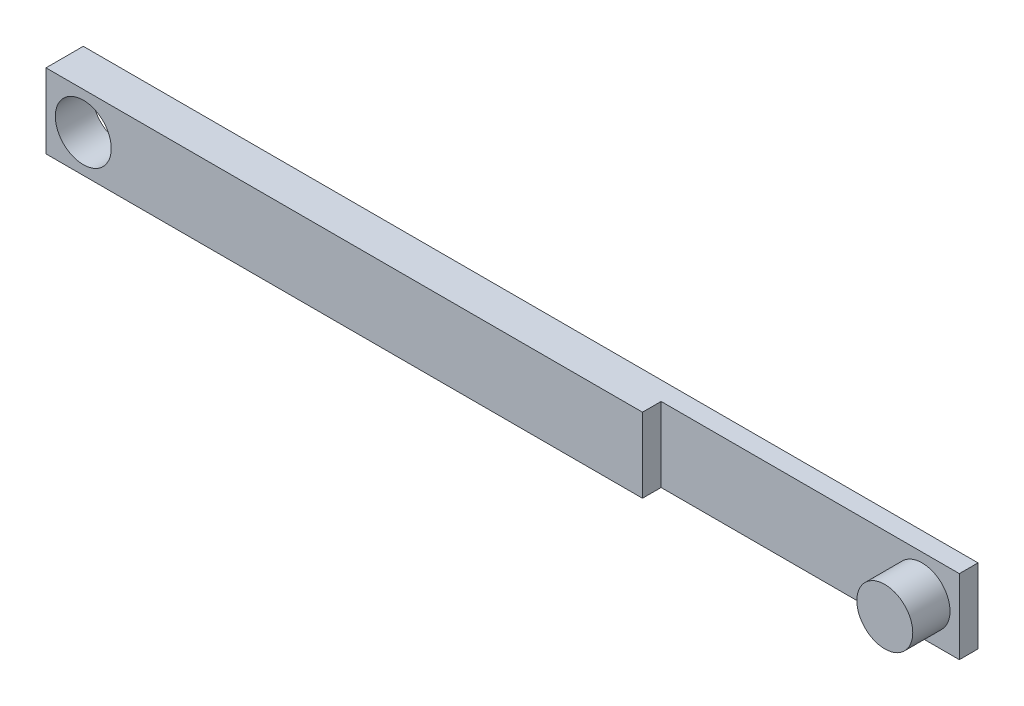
ISO-10303-21;
HEADER;
FILE_DESCRIPTION(('STEP AP214'),'2;1');
FILE_NAME('part.step','',(''),(''),'','','');
FILE_SCHEMA(('AUTOMOTIVE_DESIGN { 1 0 10303 214 1 1 1 1 }'));
ENDSEC;
DATA;
#1=APPLICATION_CONTEXT('core data for automotive mechanical design processes');
#2=APPLICATION_PROTOCOL_DEFINITION('international standard','automotive_design',2000,#1);
#3=PRODUCT_CONTEXT('',#1,'mechanical');
#4=PRODUCT('Part','Part','',(#3));
#5=PRODUCT_RELATED_PRODUCT_CATEGORY('part','',(#4));
#6=PRODUCT_DEFINITION_FORMATION('','',#4);
#7=PRODUCT_DEFINITION_CONTEXT('part definition',#1,'design');
#8=PRODUCT_DEFINITION('design','',#6,#7);
#9=PRODUCT_DEFINITION_SHAPE('','',#8);
#10=(LENGTH_UNIT() NAMED_UNIT(*) SI_UNIT(.MILLI.,.METRE.));
#11=(NAMED_UNIT(*) PLANE_ANGLE_UNIT() SI_UNIT($,.RADIAN.));
#12=(NAMED_UNIT(*) SI_UNIT($,.STERADIAN.) SOLID_ANGLE_UNIT());
#13=UNCERTAINTY_MEASURE_WITH_UNIT(LENGTH_MEASURE(1.E-05),#10,'distance_accuracy_value','');
#14=(GEOMETRIC_REPRESENTATION_CONTEXT(3) GLOBAL_UNCERTAINTY_ASSIGNED_CONTEXT((#13)) GLOBAL_UNIT_ASSIGNED_CONTEXT((#10,
#11,#12)) REPRESENTATION_CONTEXT('',''));
#15=CARTESIAN_POINT('',(0.,0.,0.));
#16=DIRECTION('',(0.,0.,1.));
#17=DIRECTION('',(1.,0.,0.));
#18=AXIS2_PLACEMENT_3D('',#15,#16,#17);
#19=CARTESIAN_POINT('',(240.,0.,5.));
#20=DIRECTION('',(0.,0.,-1.));
#21=DIRECTION('',(-1.,0.,0.));
#22=AXIS2_PLACEMENT_3D('',#19,#20,#21);
#23=PLANE('',#22);
#24=DIRECTION('',(0.,1.,0.));
#25=VECTOR('',#24,1.);
#26=CARTESIAN_POINT('',(240.,20.,5.));
#27=LINE('',#26,#25);
#28=CARTESIAN_POINT('',(240.,0.,5.));
#29=VERTEX_POINT('',#28);
#30=CARTESIAN_POINT('',(240.,20.,5.));
#31=VERTEX_POINT('',#30);
#32=EDGE_CURVE('E131',#29,#31,#27,.T.);
#33=ORIENTED_EDGE('',*,*,#32,.T.);
#34=DIRECTION('',(-1.,0.,0.));
#35=VECTOR('',#34,1.);
#36=CARTESIAN_POINT('',(240.,20.,5.));
#37=LINE('',#36,#35);
#38=CARTESIAN_POINT('',(160.,20.,5.));
#39=VERTEX_POINT('',#38);
#40=EDGE_CURVE('E138',#31,#39,#37,.T.);
#41=ORIENTED_EDGE('',*,*,#40,.T.);
#42=DIRECTION('',(0.,-1.,0.));
#43=VECTOR('',#42,1.);
#44=CARTESIAN_POINT('',(160.,20.,5.));
#45=LINE('',#44,#43);
#46=CARTESIAN_POINT('',(160.,0.,5.));
#47=VERTEX_POINT('',#46);
#48=EDGE_CURVE('E135',#39,#47,#45,.T.);
#49=ORIENTED_EDGE('',*,*,#48,.T.);
#50=DIRECTION('',(1.,0.,0.));
#51=VECTOR('',#50,1.);
#52=CARTESIAN_POINT('',(240.,0.,5.));
#53=LINE('',#52,#51);
#54=EDGE_CURVE('E127',#47,#29,#53,.T.);
#55=ORIENTED_EDGE('',*,*,#54,.T.);
#56=EDGE_LOOP('',(#33,#41,#49,#55));
#57=FACE_BOUND('',#56,.T.);
#58=CARTESIAN_POINT('',(230.,10.,5.));
#59=DIRECTION('',(0.,0.,-1.));
#60=DIRECTION('',(-1.,0.,0.));
#61=AXIS2_PLACEMENT_3D('',#58,#59,#60);
#62=CIRCLE('',#61,7.50000000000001);
#63=CARTESIAN_POINT('',(222.5,10.,5.));
#64=VERTEX_POINT('',#63);
#65=EDGE_CURVE('E11',#64,#64,#62,.F.);
#66=ORIENTED_EDGE('',*,*,#65,.F.);
#67=EDGE_LOOP('',(#66));
#68=FACE_BOUND('',#67,.T.);
#69=ADVANCED_FACE('F33',(#57,#68),#23,.F.);
#70=CARTESIAN_POINT('',(0.,0.,10.));
#71=DIRECTION('',(1.,0.,0.));
#72=DIRECTION('',(0.,0.,-1.));
#73=AXIS2_PLACEMENT_3D('',#70,#71,#72);
#74=PLANE('',#73);
#75=DIRECTION('',(0.,-1.,0.));
#76=VECTOR('',#75,1.);
#77=CARTESIAN_POINT('',(0.,0.,0.));
#78=LINE('',#77,#76);
#79=CARTESIAN_POINT('',(0.,20.,0.));
#80=VERTEX_POINT('',#79);
#81=CARTESIAN_POINT('',(0.,0.,0.));
#82=VERTEX_POINT('',#81);
#83=EDGE_CURVE('E93',#80,#82,#78,.T.);
#84=ORIENTED_EDGE('',*,*,#83,.T.);
#85=DIRECTION('',(0.,0.,-1.));
#86=VECTOR('',#85,1.);
#87=CARTESIAN_POINT('',(0.,0.,10.));
#88=LINE('',#87,#86);
#89=CARTESIAN_POINT('',(0.,0.,10.));
#90=VERTEX_POINT('',#89);
#91=EDGE_CURVE('E41',#90,#82,#88,.T.);
#92=ORIENTED_EDGE('',*,*,#91,.F.);
#93=DIRECTION('',(0.,-1.,0.));
#94=VECTOR('',#93,1.);
#95=CARTESIAN_POINT('',(0.,0.,10.));
#96=LINE('',#95,#94);
#97=CARTESIAN_POINT('',(0.,20.,10.));
#98=VERTEX_POINT('',#97);
#99=EDGE_CURVE('E87',#98,#90,#96,.T.);
#100=ORIENTED_EDGE('',*,*,#99,.F.);
#101=DIRECTION('',(0.,0.,-1.));
#102=VECTOR('',#101,1.);
#103=CARTESIAN_POINT('',(0.,20.,10.));
#104=LINE('',#103,#102);
#105=EDGE_CURVE('E78',#98,#80,#104,.T.);
#106=ORIENTED_EDGE('',*,*,#105,.T.);
#107=EDGE_LOOP('',(#84,#92,#100,#106));
#108=FACE_BOUND('',#107,.T.);
#109=ADVANCED_FACE('F35',(#108),#74,.F.);
#110=CARTESIAN_POINT('',(0.,0.,10.));
#111=DIRECTION('',(0.,1.,0.));
#112=DIRECTION('',(0.,0.,1.));
#113=AXIS2_PLACEMENT_3D('',#110,#111,#112);
#114=PLANE('',#113);
#115=ORIENTED_EDGE('',*,*,#54,.F.);
#116=DIRECTION('',(0.,0.,1.));
#117=VECTOR('',#116,1.);
#118=CARTESIAN_POINT('',(160.,0.,5.));
#119=LINE('',#118,#117);
#120=CARTESIAN_POINT('',(160.,0.,10.));
#121=VERTEX_POINT('',#120);
#122=EDGE_CURVE('E120',#47,#121,#119,.T.);
#123=ORIENTED_EDGE('',*,*,#122,.T.);
#124=DIRECTION('',(1.,0.,0.));
#125=VECTOR('',#124,1.);
#126=CARTESIAN_POINT('',(0.,0.,10.));
#127=LINE('',#126,#125);
#128=EDGE_CURVE('E117',#90,#121,#127,.T.);
#129=ORIENTED_EDGE('',*,*,#128,.F.);
#130=ORIENTED_EDGE('',*,*,#91,.T.);
#131=DIRECTION('',(1.,0.,0.));
#132=VECTOR('',#131,1.);
#133=CARTESIAN_POINT('',(0.,0.,0.));
#134=LINE('',#133,#132);
#135=CARTESIAN_POINT('',(240.,0.,0.));
#136=VERTEX_POINT('',#135);
#137=EDGE_CURVE('E97',#82,#136,#134,.T.);
#138=ORIENTED_EDGE('',*,*,#137,.T.);
#139=DIRECTION('',(0.,0.,-1.));
#140=VECTOR('',#139,1.);
#141=CARTESIAN_POINT('',(240.,0.,10.));
#142=LINE('',#141,#140);
#143=EDGE_CURVE('E110',#29,#136,#142,.T.);
#144=ORIENTED_EDGE('',*,*,#143,.F.);
#145=EDGE_LOOP('',(#115,#123,#129,#130,#138,#144));
#146=FACE_BOUND('',#145,.T.);
#147=ADVANCED_FACE('F113',(#146),#114,.F.);
#148=CARTESIAN_POINT('',(240.,0.,10.));
#149=DIRECTION('',(-1.,0.,0.));
#150=DIRECTION('',(0.,0.,1.));
#151=AXIS2_PLACEMENT_3D('',#148,#149,#150);
#152=PLANE('',#151);
#153=DIRECTION('',(0.,0.,-1.));
#154=VECTOR('',#153,1.);
#155=CARTESIAN_POINT('',(240.,20.,10.));
#156=LINE('',#155,#154);
#157=CARTESIAN_POINT('',(240.,20.,0.));
#158=VERTEX_POINT('',#157);
#159=EDGE_CURVE('E82',#31,#158,#156,.T.);
#160=ORIENTED_EDGE('',*,*,#159,.F.);
#161=ORIENTED_EDGE('',*,*,#32,.F.);
#162=ORIENTED_EDGE('',*,*,#143,.T.);
#163=DIRECTION('',(0.,1.,0.));
#164=VECTOR('',#163,1.);
#165=CARTESIAN_POINT('',(240.,0.,0.));
#166=LINE('',#165,#164);
#167=EDGE_CURVE('E88',#136,#158,#166,.T.);
#168=ORIENTED_EDGE('',*,*,#167,.T.);
#169=EDGE_LOOP('',(#160,#161,#162,#168));
#170=FACE_BOUND('',#169,.T.);
#171=ADVANCED_FACE('F177',(#170),#152,.F.);
#172=CARTESIAN_POINT('',(0.,20.,10.));
#173=DIRECTION('',(0.,-1.,0.));
#174=DIRECTION('',(0.,0.,-1.));
#175=AXIS2_PLACEMENT_3D('',#172,#173,#174);
#176=PLANE('',#175);
#177=DIRECTION('',(-1.,0.,0.));
#178=VECTOR('',#177,1.);
#179=CARTESIAN_POINT('',(0.,20.,10.));
#180=LINE('',#179,#178);
#181=CARTESIAN_POINT('',(160.,20.,10.));
#182=VERTEX_POINT('',#181);
#183=EDGE_CURVE('E56',#182,#98,#180,.T.);
#184=ORIENTED_EDGE('',*,*,#183,.F.);
#185=DIRECTION('',(0.,0.,1.));
#186=VECTOR('',#185,1.);
#187=CARTESIAN_POINT('',(160.,20.,5.));
#188=LINE('',#187,#186);
#189=EDGE_CURVE('E48',#39,#182,#188,.T.);
#190=ORIENTED_EDGE('',*,*,#189,.F.);
#191=ORIENTED_EDGE('',*,*,#40,.F.);
#192=ORIENTED_EDGE('',*,*,#159,.T.);
#193=DIRECTION('',(-1.,0.,0.));
#194=VECTOR('',#193,1.);
#195=CARTESIAN_POINT('',(0.,20.,0.));
#196=LINE('',#195,#194);
#197=EDGE_CURVE('E75',#158,#80,#196,.T.);
#198=ORIENTED_EDGE('',*,*,#197,.T.);
#199=ORIENTED_EDGE('',*,*,#105,.F.);
#200=EDGE_LOOP('',(#184,#190,#191,#192,#198,#199));
#201=FACE_BOUND('',#200,.T.);
#202=ADVANCED_FACE('F77',(#201),#176,.F.);
#203=CARTESIAN_POINT('',(0.,20.,10.));
#204=DIRECTION('',(0.,0.,-1.));
#205=DIRECTION('',(-1.,0.,0.));
#206=AXIS2_PLACEMENT_3D('',#203,#204,#205);
#207=PLANE('',#206);
#208=CARTESIAN_POINT('',(10.,10.,10.));
#209=DIRECTION('',(0.,0.,1.));
#210=DIRECTION('',(1.,0.,0.));
#211=AXIS2_PLACEMENT_3D('',#208,#209,#210);
#212=CIRCLE('',#211,7.5);
#213=CARTESIAN_POINT('',(17.5,10.,10.));
#214=VERTEX_POINT('',#213);
#215=EDGE_CURVE('E103',#214,#214,#212,.T.);
#216=ORIENTED_EDGE('',*,*,#215,.F.);
#217=EDGE_LOOP('',(#216));
#218=FACE_BOUND('',#217,.T.);
#219=ORIENTED_EDGE('',*,*,#128,.T.);
#220=DIRECTION('',(0.,-1.,0.));
#221=VECTOR('',#220,1.);
#222=CARTESIAN_POINT('',(160.,20.,10.));
#223=LINE('',#222,#221);
#224=EDGE_CURVE('E129',#182,#121,#223,.T.);
#225=ORIENTED_EDGE('',*,*,#224,.F.);
#226=ORIENTED_EDGE('',*,*,#183,.T.);
#227=ORIENTED_EDGE('',*,*,#99,.T.);
#228=EDGE_LOOP('',(#219,#225,#226,#227));
#229=FACE_BOUND('',#228,.T.);
#230=ADVANCED_FACE('F121',(#218,#229),#207,.F.);
#231=CARTESIAN_POINT('',(0.,20.,0.));
#232=DIRECTION('',(0.,0.,-1.));
#233=DIRECTION('',(-1.,0.,0.));
#234=AXIS2_PLACEMENT_3D('',#231,#232,#233);
#235=PLANE('',#234);
#236=CARTESIAN_POINT('',(10.,10.,0.));
#237=DIRECTION('',(0.,0.,1.));
#238=DIRECTION('',(1.,0.,0.));
#239=AXIS2_PLACEMENT_3D('',#236,#237,#238);
#240=CIRCLE('',#239,7.5);
#241=CARTESIAN_POINT('',(17.5,10.,0.));
#242=VERTEX_POINT('',#241);
#243=EDGE_CURVE('E99',#242,#242,#240,.T.);
#244=ORIENTED_EDGE('',*,*,#243,.T.);
#245=EDGE_LOOP('',(#244));
#246=FACE_BOUND('',#245,.T.);
#247=ORIENTED_EDGE('',*,*,#83,.F.);
#248=ORIENTED_EDGE('',*,*,#197,.F.);
#249=ORIENTED_EDGE('',*,*,#167,.F.);
#250=ORIENTED_EDGE('',*,*,#137,.F.);
#251=EDGE_LOOP('',(#247,#248,#249,#250));
#252=FACE_BOUND('',#251,.T.);
#253=ADVANCED_FACE('F95',(#246,#252),#235,.T.);
#254=CARTESIAN_POINT('',(10.,10.,0.));
#255=DIRECTION('',(0.,0.,1.));
#256=DIRECTION('',(1.,0.,0.));
#257=AXIS2_PLACEMENT_3D('',#254,#255,#256);
#258=CYLINDRICAL_SURFACE('',#257,7.5);
#259=ORIENTED_EDGE('',*,*,#243,.F.);
#260=EDGE_LOOP('',(#259));
#261=FACE_BOUND('',#260,.T.);
#262=ORIENTED_EDGE('',*,*,#215,.T.);
#263=EDGE_LOOP('',(#262));
#264=FACE_BOUND('',#263,.T.);
#265=ADVANCED_FACE('F165',(#261,#264),#258,.F.);
#266=CARTESIAN_POINT('',(160.,20.,5.));
#267=DIRECTION('',(-1.,0.,0.));
#268=DIRECTION('',(0.,0.,1.));
#269=AXIS2_PLACEMENT_3D('',#266,#267,#268);
#270=PLANE('',#269);
#271=ORIENTED_EDGE('',*,*,#224,.T.);
#272=ORIENTED_EDGE('',*,*,#122,.F.);
#273=ORIENTED_EDGE('',*,*,#48,.F.);
#274=ORIENTED_EDGE('',*,*,#189,.T.);
#275=EDGE_LOOP('',(#271,#272,#273,#274));
#276=FACE_BOUND('',#275,.T.);
#277=ADVANCED_FACE('F151',(#276),#270,.F.);
#278=CARTESIAN_POINT('',(230.,10.,15.));
#279=DIRECTION('',(0.,0.,-1.));
#280=DIRECTION('',(-1.,0.,0.));
#281=AXIS2_PLACEMENT_3D('',#278,#279,#280);
#282=CYLINDRICAL_SURFACE('',#281,7.50000000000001);
#283=CARTESIAN_POINT('',(230.,10.,15.));
#284=DIRECTION('',(0.,0.,1.));
#285=DIRECTION('',(1.,0.,0.));
#286=AXIS2_PLACEMENT_3D('',#283,#284,#285);
#287=CIRCLE('',#286,7.50000000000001);
#288=CARTESIAN_POINT('',(237.5,10.,15.));
#289=VERTEX_POINT('',#288);
#290=EDGE_CURVE('E132',#289,#289,#287,.T.);
#291=ORIENTED_EDGE('',*,*,#290,.F.);
#292=EDGE_LOOP('',(#291));
#293=FACE_BOUND('',#292,.T.);
#294=ORIENTED_EDGE('',*,*,#65,.T.);
#295=EDGE_LOOP('',(#294));
#296=FACE_BOUND('',#295,.T.);
#297=ADVANCED_FACE('F148',(#293,#296),#282,.T.);
#298=CARTESIAN_POINT('',(230.,10.,15.));
#299=DIRECTION('',(0.,0.,1.));
#300=DIRECTION('',(1.,0.,0.));
#301=AXIS2_PLACEMENT_3D('',#298,#299,#300);
#302=PLANE('',#301);
#303=ORIENTED_EDGE('',*,*,#290,.T.);
#304=EDGE_LOOP('',(#303));
#305=FACE_BOUND('',#304,.T.);
#306=ADVANCED_FACE('F146',(#305),#302,.T.);
#307=CLOSED_SHELL('',(#69,#109,#147,#171,#202,#230,#253,#265,#277,#297,#306));
#308=MANIFOLD_SOLID_BREP('B2',#307);
#309=ADVANCED_BREP_SHAPE_REPRESENTATION('',(#18,#308),#14);
#310=SHAPE_DEFINITION_REPRESENTATION(#9,#309);
ENDSEC;
END-ISO-10303-21;
